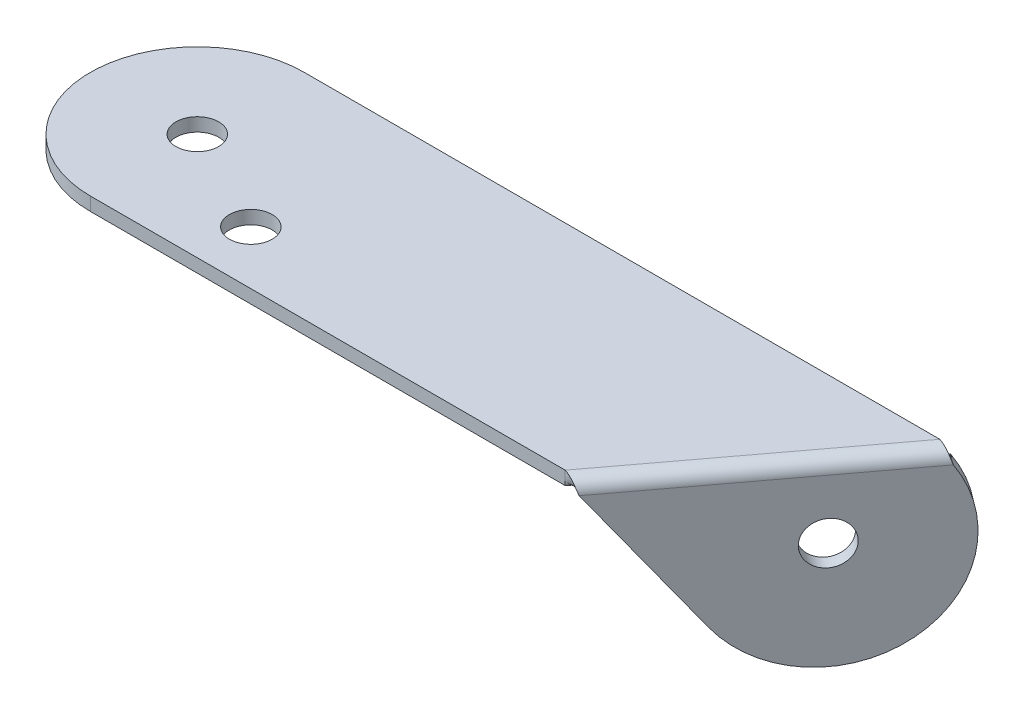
ISO-10303-21;
HEADER;
FILE_DESCRIPTION(('STEP AP214'),'2;1');
FILE_NAME('part.step','',(''),(''),'','','');
FILE_SCHEMA(('AUTOMOTIVE_DESIGN { 1 0 10303 214 1 1 1 1 }'));
ENDSEC;
DATA;
#1=APPLICATION_CONTEXT('core data for automotive mechanical design processes');
#2=APPLICATION_PROTOCOL_DEFINITION('international standard','automotive_design',2000,#1);
#3=PRODUCT_CONTEXT('',#1,'mechanical');
#4=PRODUCT('Part','Part','',(#3));
#5=PRODUCT_RELATED_PRODUCT_CATEGORY('part','',(#4));
#6=PRODUCT_DEFINITION_FORMATION('','',#4);
#7=PRODUCT_DEFINITION_CONTEXT('part definition',#1,'design');
#8=PRODUCT_DEFINITION('design','',#6,#7);
#9=PRODUCT_DEFINITION_SHAPE('','',#8);
#10=(LENGTH_UNIT() NAMED_UNIT(*) SI_UNIT(.MILLI.,.METRE.));
#11=(NAMED_UNIT(*) PLANE_ANGLE_UNIT() SI_UNIT($,.RADIAN.));
#12=(NAMED_UNIT(*) SI_UNIT($,.STERADIAN.) SOLID_ANGLE_UNIT());
#13=UNCERTAINTY_MEASURE_WITH_UNIT(LENGTH_MEASURE(1.E-05),#10,'distance_accuracy_value','');
#14=(GEOMETRIC_REPRESENTATION_CONTEXT(3) GLOBAL_UNCERTAINTY_ASSIGNED_CONTEXT((#13)) GLOBAL_UNIT_ASSIGNED_CONTEXT((#10,
#11,#12)) REPRESENTATION_CONTEXT('',''));
#15=CARTESIAN_POINT('',(0.,0.,0.));
#16=DIRECTION('',(0.,0.,1.));
#17=DIRECTION('',(1.,0.,0.));
#18=AXIS2_PLACEMENT_3D('',#15,#16,#17);
#19=CARTESIAN_POINT('',(44.6475575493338,-4.4094469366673,-2.51433183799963));
#20=DIRECTION('',(0.8,0.,0.6));
#21=DIRECTION('',(-0.480000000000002,-0.6,0.639999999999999));
#22=AXIS2_PLACEMENT_3D('',#19,#20,#21);
#23=PLANE('',#22);
#24=CARTESIAN_POINT('',(44.6475575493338,-4.4094469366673,-2.51433183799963));
#25=DIRECTION('',(0.8,0.,0.6));
#26=DIRECTION('',(-0.480000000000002,-0.6,0.639999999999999));
#27=AXIS2_PLACEMENT_3D('',#24,#25,#26);
#28=CIRCLE('',#27,1.6);
#29=CARTESIAN_POINT('',(43.8795575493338,-5.3694469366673,-1.49033183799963));
#30=VERTEX_POINT('',#29);
#31=EDGE_CURVE('E313',#30,#30,#28,.T.);
#32=ORIENTED_EDGE('',*,*,#31,.F.);
#33=EDGE_LOOP('',(#32));
#34=FACE_BOUND('',#33,.T.);
#35=CARTESIAN_POINT('',(44.6475575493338,-4.4094469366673,-2.51433183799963));
#36=DIRECTION('',(0.8,0.,0.6));
#37=DIRECTION('',(-0.480000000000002,-0.6,0.639999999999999));
#38=AXIS2_PLACEMENT_3D('',#35,#36,#37);
#39=CIRCLE('',#38,8.);
#40=CARTESIAN_POINT('',(40.8075575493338,-9.2094469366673,2.60566816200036));
#41=VERTEX_POINT('',#40);
#42=CARTESIAN_POINT('',(48.6565664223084,-0.0100000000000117,-7.85967696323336));
#43=VERTEX_POINT('',#42);
#44=EDGE_CURVE('E273',#41,#43,#39,.T.);
#45=ORIENTED_EDGE('',*,*,#44,.T.);
#46=DIRECTION('',(-0.6,0.,0.8));
#47=VECTOR('',#46,1.);
#48=CARTESIAN_POINT('',(44.6475575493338,-0.0100000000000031,-2.51433183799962));
#49=LINE('',#48,#47);
#50=CARTESIAN_POINT('',(36.6678064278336,-0.00999999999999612,8.12533632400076));
#51=VERTEX_POINT('',#50);
#52=EDGE_CURVE('E274',#43,#51,#49,.T.);
#53=ORIENTED_EDGE('',*,*,#52,.T.);
#54=DIRECTION('',(0.359999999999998,-0.8,-0.480000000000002));
#55=VECTOR('',#54,1.);
#56=CARTESIAN_POINT('',(23.5275575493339,29.1905530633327,25.6456681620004));
#57=LINE('',#56,#55);
#58=EDGE_CURVE('E82',#51,#41,#57,.T.);
#59=ORIENTED_EDGE('',*,*,#58,.T.);
#60=EDGE_LOOP('',(#45,#53,#59));
#61=FACE_BOUND('',#60,.T.);
#62=ADVANCED_FACE('F56',(#34,#61),#23,.T.);
#63=CARTESIAN_POINT('',(43.8475575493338,-4.4094469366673,-3.11433183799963));
#64=DIRECTION('',(0.8,0.,0.6));
#65=DIRECTION('',(-0.480000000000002,-0.6,0.639999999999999));
#66=AXIS2_PLACEMENT_3D('',#63,#64,#65);
#67=PLANE('',#66);
#68=DIRECTION('',(-0.6,0.,0.8));
#69=VECTOR('',#68,1.);
#70=CARTESIAN_POINT('',(43.8475575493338,-0.00999999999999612,-3.11433183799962));
#71=LINE('',#70,#69);
#72=CARTESIAN_POINT('',(47.8565664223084,-0.0100000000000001,-8.45967696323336));
#73=VERTEX_POINT('',#72);
#74=CARTESIAN_POINT('',(35.867806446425,-0.01,7.52533633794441));
#75=VERTEX_POINT('',#74);
#76=EDGE_CURVE('E67',#73,#75,#71,.T.);
#77=ORIENTED_EDGE('',*,*,#76,.F.);
#78=CARTESIAN_POINT('',(43.8475575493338,-4.4094469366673,-3.11433183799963));
#79=DIRECTION('',(0.8,0.,0.6));
#80=DIRECTION('',(-0.480000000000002,-0.6,0.639999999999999));
#81=AXIS2_PLACEMENT_3D('',#78,#79,#80);
#82=CIRCLE('',#81,8.);
#83=CARTESIAN_POINT('',(40.0075575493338,-9.20944693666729,2.00566816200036));
#84=VERTEX_POINT('',#83);
#85=EDGE_CURVE('E282',#84,#73,#82,.T.);
#86=ORIENTED_EDGE('',*,*,#85,.F.);
#87=DIRECTION('',(0.359999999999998,-0.8,-0.480000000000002));
#88=VECTOR('',#87,1.);
#89=CARTESIAN_POINT('',(22.7275575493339,29.1905530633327,25.0456681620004));
#90=LINE('',#89,#88);
#91=EDGE_CURVE('E277',#75,#84,#90,.T.);
#92=ORIENTED_EDGE('',*,*,#91,.F.);
#93=EDGE_LOOP('',(#77,#86,#92));
#94=FACE_BOUND('',#93,.T.);
#95=CARTESIAN_POINT('',(43.8475575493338,-4.4094469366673,-3.11433183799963));
#96=DIRECTION('',(0.8,0.,0.6));
#97=DIRECTION('',(-0.480000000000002,-0.6,0.639999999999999));
#98=AXIS2_PLACEMENT_3D('',#95,#96,#97);
#99=CIRCLE('',#98,1.6);
#100=CARTESIAN_POINT('',(43.0795575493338,-5.3694469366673,-2.09033183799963));
#101=VERTEX_POINT('',#100);
#102=EDGE_CURVE('E311',#101,#101,#99,.T.);
#103=ORIENTED_EDGE('',*,*,#102,.T.);
#104=EDGE_LOOP('',(#103));
#105=FACE_BOUND('',#104,.T.);
#106=ADVANCED_FACE('F300',(#94,#105),#67,.F.);
#107=CARTESIAN_POINT('',(44.6475575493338,-4.4094469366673,-2.51433183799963));
#108=DIRECTION('',(-0.8,0.,-0.6));
#109=DIRECTION('',(0.480000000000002,0.6,-0.639999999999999));
#110=AXIS2_PLACEMENT_3D('',#107,#108,#109);
#111=CYLINDRICAL_SURFACE('',#110,8.);
#112=CARTESIAN_POINT('',(48.6565664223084,-0.0100000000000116,-7.85967696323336));
#113=CARTESIAN_POINT('',(47.8565664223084,-0.0100000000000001,-8.45967696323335));
#114=B_SPLINE_CURVE_WITH_KNOTS('',1,(#112,#113),.UNSPECIFIED.,.F.,.F.,(2,2),(0.,1.),.UNSPECIFIED.);
#115=EDGE_CURVE('E160',#43,#73,#114,.T.);
#116=ORIENTED_EDGE('',*,*,#115,.F.);
#117=ORIENTED_EDGE('',*,*,#44,.F.);
#118=DIRECTION('',(-0.8,0.,-0.6));
#119=VECTOR('',#118,1.);
#120=CARTESIAN_POINT('',(40.8075575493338,-9.2094469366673,2.60566816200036));
#121=LINE('',#120,#119);
#122=EDGE_CURVE('E325',#41,#84,#121,.T.);
#123=ORIENTED_EDGE('',*,*,#122,.T.);
#124=ORIENTED_EDGE('',*,*,#85,.T.);
#125=EDGE_LOOP('',(#116,#117,#123,#124));
#126=FACE_BOUND('',#125,.T.);
#127=ADVANCED_FACE('F280',(#126),#111,.T.);
#128=CARTESIAN_POINT('',(23.5275575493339,29.1905530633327,25.6456681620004));
#129=DIRECTION('',(0.480000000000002,0.6,-0.639999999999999));
#130=DIRECTION('',(-0.359999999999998,0.8,0.480000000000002));
#131=AXIS2_PLACEMENT_3D('',#128,#129,#130);
#132=PLANE('',#131);
#133=CARTESIAN_POINT('',(35.8678064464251,-0.01,7.5253363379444));
#134=CARTESIAN_POINT('',(36.6678064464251,-0.00999999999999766,8.1253363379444));
#135=B_SPLINE_CURVE_WITH_KNOTS('',1,(#133,#134),.UNSPECIFIED.,.F.,.F.,(2,2),(0.,1.),.UNSPECIFIED.);
#136=EDGE_CURVE('E12',#75,#51,#135,.T.);
#137=ORIENTED_EDGE('',*,*,#136,.F.);
#138=ORIENTED_EDGE('',*,*,#91,.T.);
#139=ORIENTED_EDGE('',*,*,#122,.F.);
#140=ORIENTED_EDGE('',*,*,#58,.F.);
#141=EDGE_LOOP('',(#137,#138,#139,#140));
#142=FACE_BOUND('',#141,.T.);
#143=ADVANCED_FACE('F58',(#142),#132,.F.);
#144=CARTESIAN_POINT('',(44.6475575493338,-4.4094469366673,-2.51433183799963));
#145=DIRECTION('',(-0.8,0.,-0.6));
#146=DIRECTION('',(0.480000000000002,0.6,-0.639999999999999));
#147=AXIS2_PLACEMENT_3D('',#144,#145,#146);
#148=CYLINDRICAL_SURFACE('',#147,1.6);
#149=ORIENTED_EDGE('',*,*,#31,.T.);
#150=EDGE_LOOP('',(#149));
#151=FACE_BOUND('',#150,.T.);
#152=ORIENTED_EDGE('',*,*,#102,.F.);
#153=EDGE_LOOP('',(#152));
#154=FACE_BOUND('',#153,.T.);
#155=ADVANCED_FACE('F418',(#151,#154),#148,.F.);
#156=CARTESIAN_POINT('',(8.,1.,4.));
#157=DIRECTION('',(0.,-1.,0.));
#158=DIRECTION('',(0.,0.,-1.));
#159=AXIS2_PLACEMENT_3D('',#156,#157,#158);
#160=CYLINDRICAL_SURFACE('',#159,1.6);
#161=CARTESIAN_POINT('',(8.,1.,4.));
#162=DIRECTION('',(0.,1.,0.));
#163=DIRECTION('',(0.,0.,1.));
#164=AXIS2_PLACEMENT_3D('',#161,#162,#163);
#165=CIRCLE('',#164,1.6);
#166=CARTESIAN_POINT('',(8.,1.,5.6));
#167=VERTEX_POINT('',#166);
#168=EDGE_CURVE('E381',#167,#167,#165,.T.);
#169=ORIENTED_EDGE('',*,*,#168,.T.);
#170=EDGE_LOOP('',(#169));
#171=FACE_BOUND('',#170,.T.);
#172=CARTESIAN_POINT('',(8.,0.,4.));
#173=DIRECTION('',(0.,1.,0.));
#174=DIRECTION('',(0.,0.,1.));
#175=AXIS2_PLACEMENT_3D('',#172,#173,#174);
#176=CIRCLE('',#175,1.6);
#177=CARTESIAN_POINT('',(8.,0.,5.6));
#178=VERTEX_POINT('',#177);
#179=EDGE_CURVE('E365',#178,#178,#176,.T.);
#180=ORIENTED_EDGE('',*,*,#179,.F.);
#181=EDGE_LOOP('',(#180));
#182=FACE_BOUND('',#181,.T.);
#183=ADVANCED_FACE('F454',(#171,#182),#160,.F.);
#184=CARTESIAN_POINT('',(0.,1.,0.));
#185=DIRECTION('',(0.,-1.,0.));
#186=DIRECTION('',(0.,0.,-1.));
#187=AXIS2_PLACEMENT_3D('',#184,#185,#186);
#188=CYLINDRICAL_SURFACE('',#187,1.6);
#189=CARTESIAN_POINT('',(0.,1.,0.));
#190=DIRECTION('',(0.,1.,0.));
#191=DIRECTION('',(0.,0.,1.));
#192=AXIS2_PLACEMENT_3D('',#189,#190,#191);
#193=CIRCLE('',#192,1.6);
#194=CARTESIAN_POINT('',(0.,1.,1.6));
#195=VERTEX_POINT('',#194);
#196=EDGE_CURVE('E378',#195,#195,#193,.T.);
#197=ORIENTED_EDGE('',*,*,#196,.T.);
#198=EDGE_LOOP('',(#197));
#199=FACE_BOUND('',#198,.T.);
#200=CARTESIAN_POINT('',(0.,0.,0.));
#201=DIRECTION('',(0.,1.,0.));
#202=DIRECTION('',(0.,0.,1.));
#203=AXIS2_PLACEMENT_3D('',#200,#201,#202);
#204=CIRCLE('',#203,1.6);
#205=CARTESIAN_POINT('',(0.,0.,1.6));
#206=VERTEX_POINT('',#205);
#207=EDGE_CURVE('E362',#206,#206,#204,.T.);
#208=ORIENTED_EDGE('',*,*,#207,.F.);
#209=EDGE_LOOP('',(#208));
#210=FACE_BOUND('',#209,.T.);
#211=ADVANCED_FACE('F449',(#199,#210),#188,.F.);
#212=CARTESIAN_POINT('',(0.,1.,0.));
#213=DIRECTION('',(0.,-1.,0.));
#214=DIRECTION('',(0.,0.,-1.));
#215=AXIS2_PLACEMENT_3D('',#212,#213,#214);
#216=CYLINDRICAL_SURFACE('',#215,8.);
#217=CARTESIAN_POINT('',(0.,0.,0.));
#218=DIRECTION('',(0.,1.,0.));
#219=DIRECTION('',(0.,0.,1.));
#220=AXIS2_PLACEMENT_3D('',#217,#218,#219);
#221=CIRCLE('',#220,8.);
#222=CARTESIAN_POINT('',(0.,0.,-8.));
#223=VERTEX_POINT('',#222);
#224=CARTESIAN_POINT('',(0.,0.,8.));
#225=VERTEX_POINT('',#224);
#226=EDGE_CURVE('E376',#223,#225,#221,.T.);
#227=ORIENTED_EDGE('',*,*,#226,.T.);
#228=DIRECTION('',(0.,-1.,0.));
#229=VECTOR('',#228,1.);
#230=CARTESIAN_POINT('',(0.,1.,8.));
#231=LINE('',#230,#229);
#232=CARTESIAN_POINT('',(0.,1.,8.));
#233=VERTEX_POINT('',#232);
#234=EDGE_CURVE('E314',#233,#225,#231,.T.);
#235=ORIENTED_EDGE('',*,*,#234,.F.);
#236=CARTESIAN_POINT('',(0.,1.,0.));
#237=DIRECTION('',(0.,1.,0.));
#238=DIRECTION('',(0.,0.,1.));
#239=AXIS2_PLACEMENT_3D('',#236,#237,#238);
#240=CIRCLE('',#239,8.);
#241=CARTESIAN_POINT('',(0.,1.,-8.));
#242=VERTEX_POINT('',#241);
#243=EDGE_CURVE('E369',#242,#233,#240,.T.);
#244=ORIENTED_EDGE('',*,*,#243,.F.);
#245=DIRECTION('',(0.,-1.,0.));
#246=VECTOR('',#245,1.);
#247=CARTESIAN_POINT('',(0.,1.,-8.));
#248=LINE('',#247,#246);
#249=EDGE_CURVE('E373',#242,#223,#248,.T.);
#250=ORIENTED_EDGE('',*,*,#249,.T.);
#251=EDGE_LOOP('',(#227,#235,#244,#250));
#252=FACE_BOUND('',#251,.T.);
#253=ADVANCED_FACE('F446',(#252),#216,.T.);
#254=CARTESIAN_POINT('',(48.,1.,0.));
#255=DIRECTION('',(0.,1.,0.));
#256=DIRECTION('',(0.,0.,1.));
#257=AXIS2_PLACEMENT_3D('',#254,#255,#256);
#258=PLANE('',#257);
#259=DIRECTION('',(-0.6,0.,0.8));
#260=VECTOR('',#259,1.);
#261=CARTESIAN_POINT('',(43.8395575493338,1.,-3.12033183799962));
#262=LINE('',#261,#260);
#263=CARTESIAN_POINT('',(47.4993086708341,1.00000002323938,-7.99999999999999));
#264=VERTEX_POINT('',#263);
#265=CARTESIAN_POINT('',(35.4993086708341,1.00000002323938,8.));
#266=VERTEX_POINT('',#265);
#267=EDGE_CURVE('E140',#264,#266,#262,.T.);
#268=ORIENTED_EDGE('',*,*,#267,.F.);
#269=DIRECTION('',(-1.,0.,0.));
#270=VECTOR('',#269,1.);
#271=CARTESIAN_POINT('',(48.,1.,-8.));
#272=LINE('',#271,#270);
#273=EDGE_CURVE('E372',#264,#242,#272,.T.);
#274=ORIENTED_EDGE('',*,*,#273,.T.);
#275=ORIENTED_EDGE('',*,*,#243,.T.);
#276=DIRECTION('',(1.,0.,0.));
#277=VECTOR('',#276,1.);
#278=CARTESIAN_POINT('',(0.,1.,8.));
#279=LINE('',#278,#277);
#280=EDGE_CURVE('E371',#233,#266,#279,.T.);
#281=ORIENTED_EDGE('',*,*,#280,.T.);
#282=EDGE_LOOP('',(#268,#274,#275,#281));
#283=FACE_BOUND('',#282,.T.);
#284=ORIENTED_EDGE('',*,*,#196,.F.);
#285=EDGE_LOOP('',(#284));
#286=FACE_BOUND('',#285,.T.);
#287=ORIENTED_EDGE('',*,*,#168,.F.);
#288=EDGE_LOOP('',(#287));
#289=FACE_BOUND('',#288,.T.);
#290=ADVANCED_FACE('F410',(#283,#286,#289),#258,.T.);
#291=CARTESIAN_POINT('',(48.,1.,-8.));
#292=DIRECTION('',(0.,0.,1.));
#293=DIRECTION('',(1.,0.,0.));
#294=AXIS2_PLACEMENT_3D('',#291,#292,#293);
#295=PLANE('',#294);
#296=ORIENTED_EDGE('',*,*,#273,.F.);
#297=CARTESIAN_POINT('',(47.4993086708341,2.32393819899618E-08,-7.99999999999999));
#298=CARTESIAN_POINT('',(47.4993086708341,1.00000002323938,-7.99999999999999));
#299=B_SPLINE_CURVE_WITH_KNOTS('',1,(#297,#298),.UNSPECIFIED.,.F.,.F.,(2,2),(0.,1.),.UNSPECIFIED.);
#300=CARTESIAN_POINT('',(47.4993086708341,0.,-8.));
#301=VERTEX_POINT('',#300);
#302=EDGE_CURVE('E221',#264,#301,#299,.F.);
#303=ORIENTED_EDGE('',*,*,#302,.T.);
#304=DIRECTION('',(-1.,0.,0.));
#305=VECTOR('',#304,1.);
#306=CARTESIAN_POINT('',(48.,0.,-8.));
#307=LINE('',#306,#305);
#308=EDGE_CURVE('E368',#301,#223,#307,.T.);
#309=ORIENTED_EDGE('',*,*,#308,.T.);
#310=ORIENTED_EDGE('',*,*,#249,.F.);
#311=EDGE_LOOP('',(#296,#303,#309,#310));
#312=FACE_BOUND('',#311,.T.);
#313=ADVANCED_FACE('F399',(#312),#295,.F.);
#314=CARTESIAN_POINT('',(48.,0.,0.));
#315=DIRECTION('',(0.,1.,0.));
#316=DIRECTION('',(0.,0.,1.));
#317=AXIS2_PLACEMENT_3D('',#314,#315,#316);
#318=PLANE('',#317);
#319=ORIENTED_EDGE('',*,*,#179,.T.);
#320=EDGE_LOOP('',(#319));
#321=FACE_BOUND('',#320,.T.);
#322=ORIENTED_EDGE('',*,*,#207,.T.);
#323=EDGE_LOOP('',(#322));
#324=FACE_BOUND('',#323,.T.);
#325=ORIENTED_EDGE('',*,*,#308,.F.);
#326=DIRECTION('',(-0.6,0.,0.8));
#327=VECTOR('',#326,1.);
#328=CARTESIAN_POINT('',(43.8395575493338,0.,-3.12033183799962));
#329=LINE('',#328,#327);
#330=CARTESIAN_POINT('',(35.4993086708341,2.32393817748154E-08,8.00000000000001));
#331=VERTEX_POINT('',#330);
#332=EDGE_CURVE('E152',#301,#331,#329,.T.);
#333=ORIENTED_EDGE('',*,*,#332,.T.);
#334=DIRECTION('',(1.,0.,0.));
#335=VECTOR('',#334,1.);
#336=CARTESIAN_POINT('',(0.,0.,8.));
#337=LINE('',#336,#335);
#338=EDGE_CURVE('E385',#225,#331,#337,.T.);
#339=ORIENTED_EDGE('',*,*,#338,.F.);
#340=ORIENTED_EDGE('',*,*,#226,.F.);
#341=EDGE_LOOP('',(#325,#333,#339,#340));
#342=FACE_BOUND('',#341,.T.);
#343=ADVANCED_FACE('F409',(#321,#324,#342),#318,.F.);
#344=CARTESIAN_POINT('',(0.,1.,8.));
#345=DIRECTION('',(0.,0.,-1.));
#346=DIRECTION('',(-1.,0.,0.));
#347=AXIS2_PLACEMENT_3D('',#344,#345,#346);
#348=PLANE('',#347);
#349=ORIENTED_EDGE('',*,*,#338,.T.);
#350=CARTESIAN_POINT('',(35.4993086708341,1.00000002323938,8.));
#351=CARTESIAN_POINT('',(35.4993086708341,2.32393819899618E-08,8.00000000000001));
#352=B_SPLINE_CURVE_WITH_KNOTS('',1,(#350,#351),.UNSPECIFIED.,.F.,.F.,(2,2),(0.,1.),.UNSPECIFIED.);
#353=EDGE_CURVE('E319',#331,#266,#352,.F.);
#354=ORIENTED_EDGE('',*,*,#353,.T.);
#355=ORIENTED_EDGE('',*,*,#280,.F.);
#356=ORIENTED_EDGE('',*,*,#234,.T.);
#357=EDGE_LOOP('',(#349,#354,#355,#356));
#358=FACE_BOUND('',#357,.T.);
#359=ADVANCED_FACE('F185',(#358),#348,.F.);
#360=CARTESIAN_POINT('',(48.6565664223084,-0.0100000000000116,-7.85967696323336));
#361=CARTESIAN_POINT('',(48.6283937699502,0.122229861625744,-7.82211342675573));
#362=CARTESIAN_POINT('',(48.5792000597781,0.254365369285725,-7.80033447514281));
#363=CARTESIAN_POINT('',(48.4419132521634,0.4986551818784,-7.78593232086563));
#364=CARTESIAN_POINT('',(48.3538729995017,0.610677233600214,-7.79328827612));
#365=CARTESIAN_POINT('',(48.2508998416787,0.704177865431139,-7.81182511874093));
#366=CARTESIAN_POINT('',(47.8565664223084,-0.0100000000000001,-8.45967696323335));
#367=CARTESIAN_POINT('',(47.828398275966,-0.00869099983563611,-8.42211943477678));
#368=CARTESIAN_POINT('',(47.8000219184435,-0.00738251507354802,-8.3847180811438));
#369=CARTESIAN_POINT('',(47.74288414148,-0.00496379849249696,-8.31020415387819));
#370=CARTESIAN_POINT('',(47.7141230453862,-0.0038545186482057,-8.27309135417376));
#371=CARTESIAN_POINT('',(47.6852144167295,-0.00292891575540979,-8.23608918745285));
#372=B_SPLINE_SURFACE_WITH_KNOTS('',1,3,((#360,#361,#362,#363,#364,#365),(#366,#367,#368,#369,
#370,#371)),.UNSPECIFIED.,.F.,.F.,.F.,(2,2),(4,2,4),(0.,1.),(0.,0.5,1.),.UNSPECIFIED.);
#373=CARTESIAN_POINT('',(47.8565664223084,-0.0100000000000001,-8.45967696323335));
#374=CARTESIAN_POINT('',(47.828398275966,-0.00869099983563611,-8.42211943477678));
#375=CARTESIAN_POINT('',(47.8000219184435,-0.00738251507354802,-8.3847180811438));
#376=CARTESIAN_POINT('',(47.74288414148,-0.00496379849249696,-8.31020415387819));
#377=CARTESIAN_POINT('',(47.7141230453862,-0.0038545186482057,-8.27309135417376));
#378=CARTESIAN_POINT('',(47.6852144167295,-0.00292891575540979,-8.23608918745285));
#379=B_SPLINE_CURVE_WITH_KNOTS('',3,(#373,#374,#375,#376,#377,#378),.UNSPECIFIED.,.F.,.F.,(4,2,
4),(0.,0.5,1.),.UNSPECIFIED.);
#380=CARTESIAN_POINT('',(47.6852144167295,-0.00292891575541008,-8.23608918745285));
#381=VERTEX_POINT('',#380);
#382=EDGE_CURVE('E147',#73,#381,#379,.T.);
#383=CARTESIAN_POINT('',(47.6852144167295,-0.00292891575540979,-8.23608918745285));
#384=CARTESIAN_POINT('',(48.2508998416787,0.704177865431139,-7.81182511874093));
#385=B_SPLINE_CURVE_WITH_KNOTS('',1,(#383,#384),.UNSPECIFIED.,.F.,.F.,(2,2),(0.,1.),.UNSPECIFIED.);
#386=CARTESIAN_POINT('',(48.2508998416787,0.704177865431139,-7.81182511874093));
#387=VERTEX_POINT('',#386);
#388=EDGE_CURVE('E125',#381,#387,#385,.T.);
#389=CARTESIAN_POINT('',(48.2508998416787,0.704177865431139,-7.81182511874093));
#390=CARTESIAN_POINT('',(48.3538729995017,0.610677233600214,-7.79328827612));
#391=CARTESIAN_POINT('',(48.4419132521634,0.4986551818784,-7.78593232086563));
#392=CARTESIAN_POINT('',(48.5792000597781,0.254365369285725,-7.80033447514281));
#393=CARTESIAN_POINT('',(48.6283937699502,0.122229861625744,-7.82211342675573));
#394=CARTESIAN_POINT('',(48.6565664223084,-0.0100000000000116,-7.85967696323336));
#395=B_SPLINE_CURVE_WITH_KNOTS('',3,(#389,#390,#391,#392,#393,#394),.UNSPECIFIED.,.F.,.F.,(4,2,
4),(0.,0.5,1.),.UNSPECIFIED.);
#396=EDGE_CURVE('E270',#43,#387,#395,.F.);
#397=ORIENTED_EDGE('',*,*,#115,.T.);
#398=ORIENTED_EDGE('',*,*,#382,.T.);
#399=ORIENTED_EDGE('',*,*,#388,.T.);
#400=ORIENTED_EDGE('',*,*,#396,.F.);
#401=EDGE_LOOP('',(#397,#398,#399,#400));
#402=FACE_BOUND('',#401,.T.);
#403=ADVANCED_FACE('F158',(#402),#372,.T.);
#404=CARTESIAN_POINT('',(48.2508998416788,0.704177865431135,-7.81182511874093));
#405=CARTESIAN_POINT('',(48.1460533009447,0.79767827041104,-7.82786373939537));
#406=CARTESIAN_POINT('',(48.0263987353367,0.872524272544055,-7.85502811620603));
#407=CARTESIAN_POINT('',(47.7708839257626,0.973712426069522,-7.92149139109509));
#408=CARTESIAN_POINT('',(47.6351385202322,1.00000002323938,-7.96072389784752));
#409=CARTESIAN_POINT('',(47.4993086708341,1.00000002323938,-7.99999999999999));
#410=CARTESIAN_POINT('',(47.6852144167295,-0.00292891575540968,-8.23608918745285));
#411=CARTESIAN_POINT('',(47.6544324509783,-0.00200331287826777,-8.1965892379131));
#412=CARTESIAN_POINT('',(47.6235035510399,-0.00126211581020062,-8.15719950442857));
#413=CARTESIAN_POINT('',(47.5614856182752,-0.000260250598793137,-8.07854012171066));
#414=CARTESIAN_POINT('',(47.5303973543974,2.3239382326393E-08,-8.03926991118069));
#415=CARTESIAN_POINT('',(47.4993086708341,2.32393819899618E-08,-7.99999999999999));
#416=B_SPLINE_SURFACE_WITH_KNOTS('',1,3,((#404,#405,#406,#407,#408,#409),(#410,#411,#412,#413,
#414,#415)),.UNSPECIFIED.,.F.,.F.,.F.,(2,2),(4,2,4),(0.,1.),(0.,0.5,1.),.UNSPECIFIED.);
#417=CARTESIAN_POINT('',(47.6852144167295,-0.00292891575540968,-8.23608918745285));
#418=CARTESIAN_POINT('',(47.6544324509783,-0.00200331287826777,-8.1965892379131));
#419=CARTESIAN_POINT('',(47.6235035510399,-0.00126211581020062,-8.15719950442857));
#420=CARTESIAN_POINT('',(47.5614856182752,-0.000260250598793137,-8.07854012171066));
#421=CARTESIAN_POINT('',(47.5303973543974,2.3239382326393E-08,-8.03926991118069));
#422=CARTESIAN_POINT('',(47.4993086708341,2.32393819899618E-08,-7.99999999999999));
#423=B_SPLINE_CURVE_WITH_KNOTS('',3,(#417,#418,#419,#420,#421,#422),.UNSPECIFIED.,.F.,.F.,(4,2,
4),(0.,0.5,1.),.UNSPECIFIED.);
#424=EDGE_CURVE('E129',#381,#301,#423,.T.);
#425=CARTESIAN_POINT('',(47.4993086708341,1.00000002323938,-7.99999999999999));
#426=CARTESIAN_POINT('',(47.6351385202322,1.00000002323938,-7.96072389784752));
#427=CARTESIAN_POINT('',(47.7708839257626,0.973712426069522,-7.92149139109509));
#428=CARTESIAN_POINT('',(48.0263987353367,0.872524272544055,-7.85502811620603));
#429=CARTESIAN_POINT('',(48.1460533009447,0.79767827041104,-7.82786373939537));
#430=CARTESIAN_POINT('',(48.2508998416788,0.704177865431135,-7.81182511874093));
#431=B_SPLINE_CURVE_WITH_KNOTS('',3,(#425,#426,#427,#428,#429,#430),.UNSPECIFIED.,.F.,.F.,(4,2,
4),(0.,0.5,1.),.UNSPECIFIED.);
#432=EDGE_CURVE('E133',#387,#264,#431,.F.);
#433=ORIENTED_EDGE('',*,*,#388,.F.);
#434=ORIENTED_EDGE('',*,*,#424,.T.);
#435=ORIENTED_EDGE('',*,*,#302,.F.);
#436=ORIENTED_EDGE('',*,*,#432,.F.);
#437=EDGE_LOOP('',(#433,#434,#435,#436));
#438=FACE_BOUND('',#437,.T.);
#439=ADVANCED_FACE('F128',(#438),#416,.T.);
#440=CARTESIAN_POINT('',(35.4993086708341,1.00000002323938,8.));
#441=CARTESIAN_POINT('',(35.6351385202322,1.00000002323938,8.03927610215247));
#442=CARTESIAN_POINT('',(35.7708839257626,0.973712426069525,8.0785086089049));
#443=CARTESIAN_POINT('',(36.0263987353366,0.872524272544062,8.14497188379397));
#444=CARTESIAN_POINT('',(36.146069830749,0.797663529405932,8.17213878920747));
#445=CARTESIAN_POINT('',(36.3557298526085,0.610692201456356,8.20421097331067));
#446=CARTESIAN_POINT('',(36.445659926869,0.498655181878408,8.20907211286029));
#447=CARTESIAN_POINT('',(36.5866934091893,0.254365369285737,8.18967439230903));
#448=CARTESIAN_POINT('',(36.6377602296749,0.122229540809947,8.1653979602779));
#449=CARTESIAN_POINT('',(36.6678064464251,-0.00999999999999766,8.1253363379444));
#450=CARTESIAN_POINT('',(35.4993086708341,2.32393819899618E-08,8.00000000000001));
#451=CARTESIAN_POINT('',(35.5303973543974,2.32393822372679E-08,7.9607300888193));
#452=CARTESIAN_POINT('',(35.5614856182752,-0.000260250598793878,7.92145987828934));
#453=CARTESIAN_POINT('',(35.6235035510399,-0.00126211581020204,7.84280049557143));
#454=CARTESIAN_POINT('',(35.654432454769,-0.00200331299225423,7.80341075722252));
#455=CARTESIAN_POINT('',(35.71599637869,-0.00385451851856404,7.72441086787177));
#456=CARTESIAN_POINT('',(35.7466308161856,-0.00496379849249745,7.68480027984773));
#457=CARTESIAN_POINT('',(35.8075152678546,-0.00738251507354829,7.60529078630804));
#458=CARTESIAN_POINT('',(35.8377649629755,-0.0086909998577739,7.56539164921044));
#459=CARTESIAN_POINT('',(35.8678064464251,-0.01,7.5253363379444));
#460=B_SPLINE_SURFACE_WITH_KNOTS('',1,3,((#440,#441,#442,#443,#444,#445,#446,#447,#448,#449),
(#450,#451,#452,#453,#454,#455,#456,#457,#458,#459)),.UNSPECIFIED.,.F.,.F.,.F.,(2,2),(4,2,2,2,
4),(0.,1.),(0.,0.25,0.5,0.75,1.),.UNSPECIFIED.);
#461=CARTESIAN_POINT('',(35.4993086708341,2.32393819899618E-08,8.00000000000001));
#462=CARTESIAN_POINT('',(35.5303973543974,2.32393822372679E-08,7.9607300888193));
#463=CARTESIAN_POINT('',(35.5614856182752,-0.000260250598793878,7.92145987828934));
#464=CARTESIAN_POINT('',(35.6235035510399,-0.00126211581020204,7.84280049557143));
#465=CARTESIAN_POINT('',(35.654432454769,-0.00200331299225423,7.80341075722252));
#466=CARTESIAN_POINT('',(35.71599637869,-0.00385451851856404,7.72441086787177));
#467=CARTESIAN_POINT('',(35.7466308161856,-0.00496379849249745,7.68480027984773));
#468=CARTESIAN_POINT('',(35.8075152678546,-0.00738251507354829,7.60529078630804));
#469=CARTESIAN_POINT('',(35.8377649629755,-0.0086909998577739,7.56539164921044));
#470=CARTESIAN_POINT('',(35.8678064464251,-0.01,7.5253363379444));
#471=B_SPLINE_CURVE_WITH_KNOTS('',3,(#461,#462,#463,#464,#465,#466,#467,#468,#469,#470),
.UNSPECIFIED.,.F.,.F.,(4,2,2,2,4),(0.,0.25,0.5,0.75,1.),.UNSPECIFIED.);
#472=EDGE_CURVE('E154',#331,#75,#471,.T.);
#473=CARTESIAN_POINT('',(36.6678064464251,-0.00999999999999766,8.1253363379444));
#474=CARTESIAN_POINT('',(36.6377602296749,0.122229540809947,8.1653979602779));
#475=CARTESIAN_POINT('',(36.5866934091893,0.254365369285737,8.18967439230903));
#476=CARTESIAN_POINT('',(36.445659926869,0.498655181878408,8.20907211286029));
#477=CARTESIAN_POINT('',(36.3557298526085,0.610692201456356,8.20421097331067));
#478=CARTESIAN_POINT('',(36.146069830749,0.797663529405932,8.17213878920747));
#479=CARTESIAN_POINT('',(36.0263987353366,0.872524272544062,8.14497188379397));
#480=CARTESIAN_POINT('',(35.7708839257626,0.973712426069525,8.0785086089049));
#481=CARTESIAN_POINT('',(35.6351385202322,1.00000002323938,8.03927610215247));
#482=CARTESIAN_POINT('',(35.4993086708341,1.00000002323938,8.));
#483=B_SPLINE_CURVE_WITH_KNOTS('',3,(#473,#474,#475,#476,#477,#478,#479,#480,#481,#482),
.UNSPECIFIED.,.F.,.F.,(4,2,2,2,4),(0.,0.25,0.5,0.75,1.),.UNSPECIFIED.);
#484=EDGE_CURVE('E74',#266,#51,#483,.F.);
#485=ORIENTED_EDGE('',*,*,#472,.T.);
#486=ORIENTED_EDGE('',*,*,#136,.T.);
#487=ORIENTED_EDGE('',*,*,#484,.F.);
#488=ORIENTED_EDGE('',*,*,#353,.F.);
#489=EDGE_LOOP('',(#485,#486,#487,#488));
#490=FACE_BOUND('',#489,.T.);
#491=ADVANCED_FACE('F189',(#490),#460,.T.);
#492=CARTESIAN_POINT('',(29.1191725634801,-0.01,16.5068481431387));
#493=DIRECTION('',(0.6,0.,-0.8));
#494=DIRECTION('',(-0.8,0.,-0.6));
#495=AXIS2_PLACEMENT_3D('',#492,#493,#494);
#496=CYLINDRICAL_SURFACE('',#495,1.01000002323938);
#497=ORIENTED_EDGE('',*,*,#267,.T.);
#498=ORIENTED_EDGE('',*,*,#484,.T.);
#499=ORIENTED_EDGE('',*,*,#52,.F.);
#500=ORIENTED_EDGE('',*,*,#396,.T.);
#501=ORIENTED_EDGE('',*,*,#432,.T.);
#502=EDGE_LOOP('',(#497,#498,#499,#500,#501));
#503=FACE_BOUND('',#502,.T.);
#504=ADVANCED_FACE('F255',(#503),#496,.T.);
#505=CARTESIAN_POINT('',(29.1191725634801,-0.01,16.5068481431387));
#506=DIRECTION('',(0.6,0.,-0.8));
#507=DIRECTION('',(-0.8,0.,-0.6));
#508=AXIS2_PLACEMENT_3D('',#505,#506,#507);
#509=CYLINDRICAL_SURFACE('',#508,0.0100000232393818);
#510=ORIENTED_EDGE('',*,*,#332,.F.);
#511=ORIENTED_EDGE('',*,*,#424,.F.);
#512=ORIENTED_EDGE('',*,*,#382,.F.);
#513=ORIENTED_EDGE('',*,*,#76,.T.);
#514=ORIENTED_EDGE('',*,*,#472,.F.);
#515=EDGE_LOOP('',(#510,#511,#512,#513,#514));
#516=FACE_BOUND('',#515,.T.);
#517=ADVANCED_FACE('F146',(#516),#509,.F.);
#518=CLOSED_SHELL('',(#62,#106,#127,#143,#155,#183,#211,#253,#290,#313,#343,#359,#403,#439,#491,
#504,#517));
#519=MANIFOLD_SOLID_BREP('B2',#518);
#520=ADVANCED_BREP_SHAPE_REPRESENTATION('',(#18,#519),#14);
#521=SHAPE_DEFINITION_REPRESENTATION(#9,#520);
ENDSEC;
END-ISO-10303-21;
